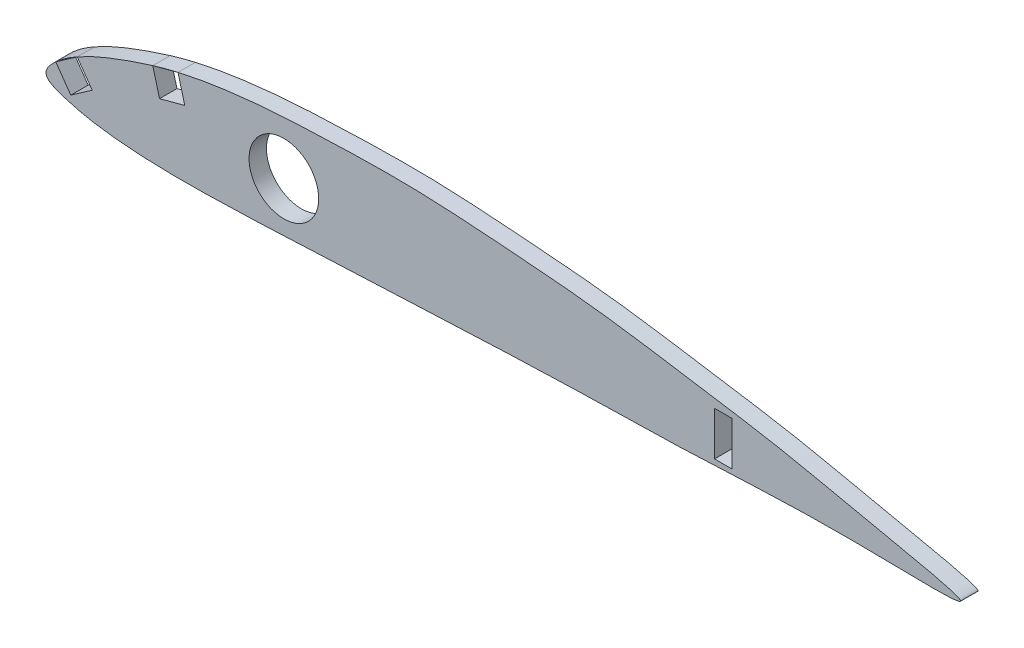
from build123d import *

# Parameters (mm, degrees)
BOSS_EXTRUDE1_DEPTH = 3.175
SKETCH1_R           = 6.35
SKETCH1_W           = 3.175
SKETCH1_H           = 8
CUT_EXTRUDE2_DEPTH  = 10


with BuildPart() as part:
    # 3DSketch1 → Boss-Extrude1 (new body)
    with BuildSketch(Plane(origin=(0, 0, 0), x_dir=(0.999981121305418, -0.006144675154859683, 0), z_dir=(0, 0, 1))):
        with BuildLine():
            add(Edge.make_bspline(
                [(0, 0), (-0.051415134, 0.891730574), (1.884090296, 2.906101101), (4.638406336, 4.904483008), (8.212120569, 6.857316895), (15.061472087, 9.692613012), (23.374630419, 12.40135684), (33.224699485, 14.038692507), (41.576291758, 14.924015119), (52.697035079, 15.458558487), (66.613113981, 15.938853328), (83.278776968, 14.872053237), (100.065562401, 13.667756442), (116.479731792, 11.141680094), (134.086905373, 8.560591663), (147.530849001, 5.484891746), (176.142141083, 0), (139.15905917, 1.0751463), (123.088513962, -0.495197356), (88.380382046, -1.25568021), (61.255609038, -2.90090553), (33.326373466, -4.290306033), (19.598352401, -4.59979394), (9.486830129, -3.683141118), (4.335039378, -2.538452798), (0.070554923, -1.223686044), (0, 0)],
                knots=[0, 0, 0, 0, 0.010560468, 0.018211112, 0.032209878, 0.045524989, 0.084069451, 0.108974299, 0.133649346, 0.158232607, 0.207343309, 0.256522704, 0.305826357, 0.355445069, 0.405214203, 0.45539047, 0.506006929, 0.555121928, 0.653369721, 0.702490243, 0.849938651, 0.899083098, 0.948194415, 0.97290595, 0.985508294, 1, 1, 1, 1], degree=3))
        make_face()
    extrude(amount=BOSS_EXTRUDE1_DEPTH)

    # Sketch1 → Cut-Extrude2 (cut)
    with BuildSketch(Plane.XY.offset(3.175)):
        with Locations((43.365, 5)):
            Circle(SKETCH1_R)
        Polygon((5.687648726, 5.386294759), (1.786437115, 2.65463698), (4.518094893, -1.24657463), (8.419306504, 1.485083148), align=None)
        with Locations((123.4595, 4)):
            Rectangle(SKETCH1_W, SKETCH1_H)
        Polygon((19.465770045, 10.890029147), (24.065991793, 12.122654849), (25.298617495, 7.522433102), (20.698395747, 6.289807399), align=None)
    extrude(amount=-CUT_EXTRUDE2_DEPTH, mode=Mode.SUBTRACT)


solid = part.part
